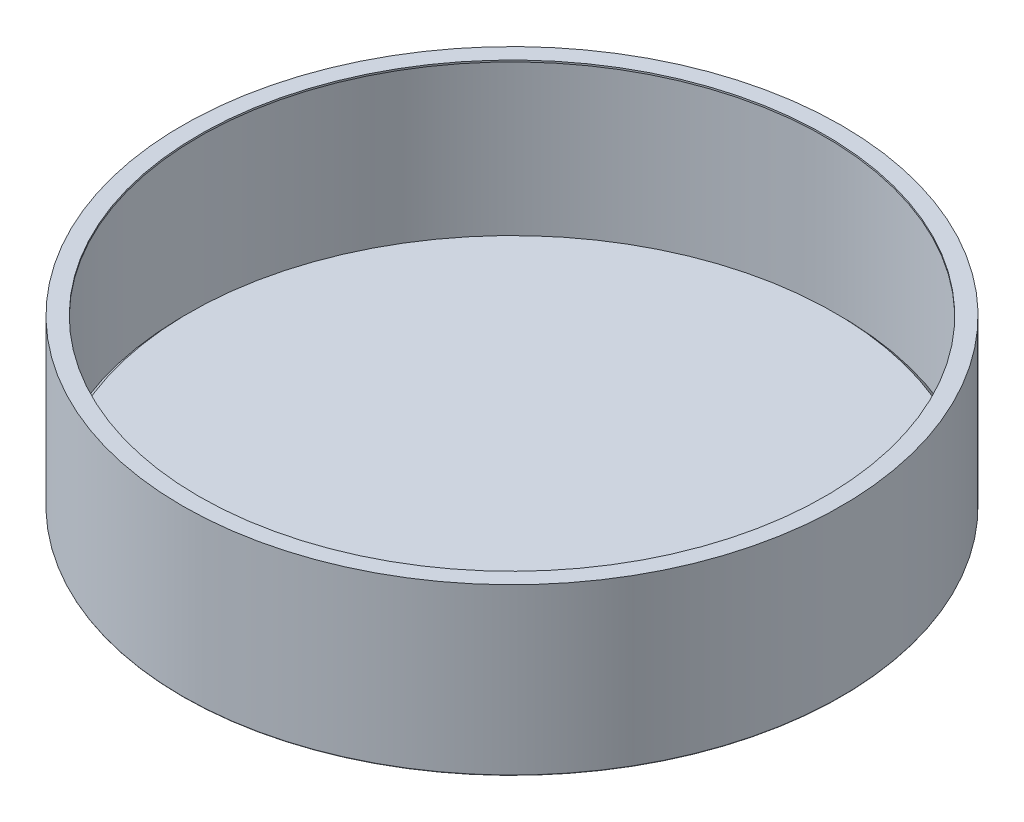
from build123d import *

# Parameters (mm, degrees)
MATRIZC1_COUNT = 4


with BuildPart() as part:
    # Croquis1 → Revoluci_n4 (revolve)
    with BuildSketch(Plane.XY, mode=Mode.PRIVATE) as revoluci_n4_sk:
        with BuildLine():
            Line((0, 0), (-195.975685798, 0))
            Line((-195.975685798, 0), (-198.900626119, -2.858609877))
            ThreePointArc((-198.900626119, -2.858609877), (-199.061411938, -2.964054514), (-199.250101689, -3.001025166))
            Line((-199.250101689, -3.001025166), (-199.530777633, -3.001025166))
            ThreePointArc((-199.530777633, -3.001025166), (-199.884331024, -2.854578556), (-200.030777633, -2.501025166))
            Line((-200.030777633, -2.501025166), (-200.030777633, 97.473432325))
            Line((-200.030777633, 97.473432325), (-190.030777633, 97.473432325))
            Line((-190.030777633, 97.473432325), (-190.030777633, 96.473432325))
            Line((-190.030777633, 96.473432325), (-198.986716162, 96.473432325))
            Line((-198.986716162, 96.473432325), (-198.986716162, -2.018824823))
            Line((-198.986716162, -2.018824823), (-195.975685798, 1))
            Line((-195.975685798, 1), (0, 1))
            Line((0, 1), (0, 0))
        make_face()
    revolve(revoluci_n4_sk.sketch.rotate(Axis((0, 96.146887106, 0), (0, -1, 0)), 270), axis=Axis((0, 96.146887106, 0), (0, -1, 0)))

    # Croquis3 → Revoluci_n5 (revolve)
    with BuildSketch(Plane.XY, mode=Mode.PRIVATE) as revoluci_n5_sk:
        Polygon((-106, 0), (-100, 0), (-100, -2), (-103, -2), align=None)
    revoluci_n5 = revolve(revoluci_n5_sk.sketch.rotate(Axis((-100, -6.075997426, 0), (0, -1, 0)), 270), axis=Axis((-100, -6.075997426, 0), (0, -1, 0)))

    # MatrizC1: Revoluci_n5 ×4 about axis
    matrizc1_axis = Axis((0.093822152, 0, 0), (0, 1, 0))
    for i in range(1, MATRIZC1_COUNT):
        add(revoluci_n5.rotate(matrizc1_axis, i * 360 / MATRIZC1_COUNT))


solid = part.part
